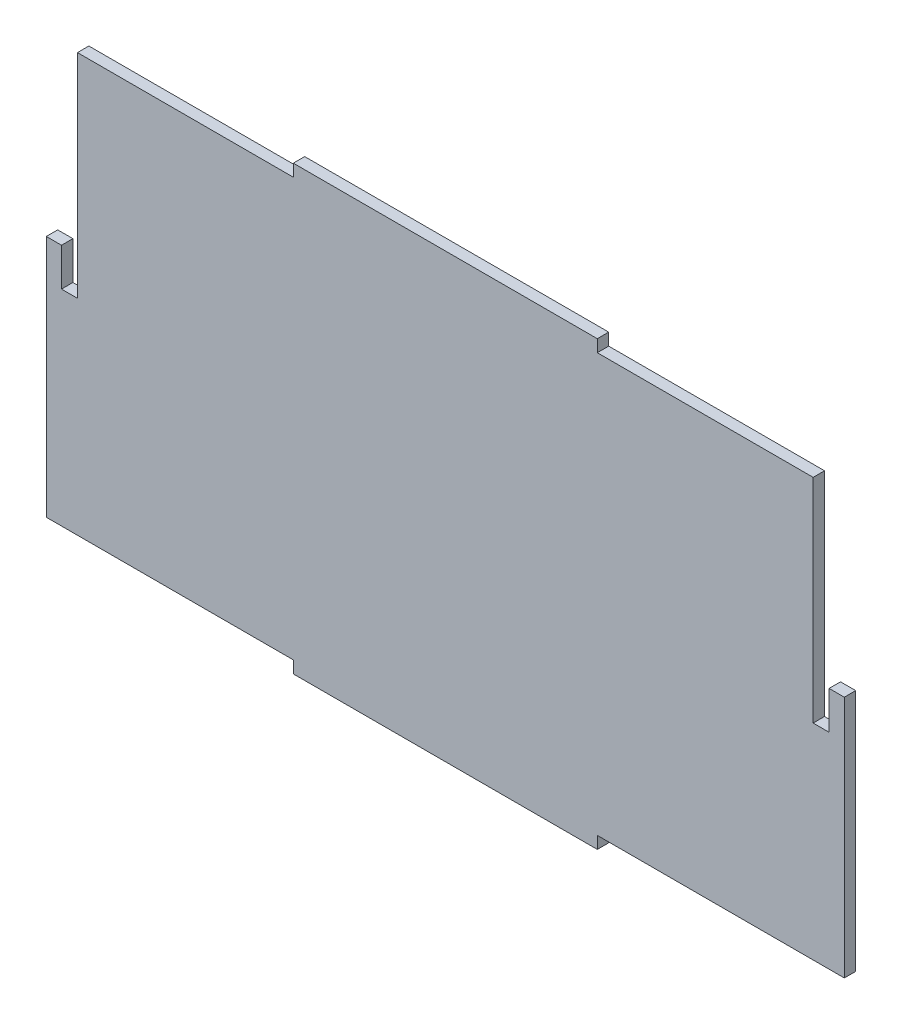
from build123d import *

# Parameters (mm, degrees)
BOSS_EXTRU_1_DEPTH      = 1.5
ESQUISSE2_W             = 2
ESQUISSE2_H             = 23
ENL_V_MAT_EXTRU_1_DEPTH = 10


with BuildPart() as part:
    # Esquisse1 → Boss.-Extru.1 (new body)
    with BuildSketch(Plane.XY):
        Polygon((-52.5, 27.5), (-50.5, 27.5), (-50.5, -0.5), (-48.4, -0.5), (-48.4, 27.5), (-20, 27.5), (-20, 29.1), (20, 29.1), (20, 27.5), (48.4, 27.5), (48.4, -0.5), (50.5, -0.5), (50.5, 27.5), (52.5, 27.5), (52.5, -27.5), (20, -27.5), (20, -29.1), (-20, -29.1), (-20, -27.5), (-52.5, -27.5), align=None)
    extrude(amount=BOSS_EXTRU_1_DEPTH)

    # Esquisse2 → Enl_v. mat.-Extru.1 (cut)
    with BuildSketch(Plane.XY.offset(1.5)):
        with Locations((-51.5, 16)):
            Rectangle(ESQUISSE2_W, ESQUISSE2_H)
        with Locations((51.5, 16)):
            Rectangle(ESQUISSE2_W, ESQUISSE2_H)
    extrude(amount=-ENL_V_MAT_EXTRU_1_DEPTH, mode=Mode.SUBTRACT)


solid = part.part
